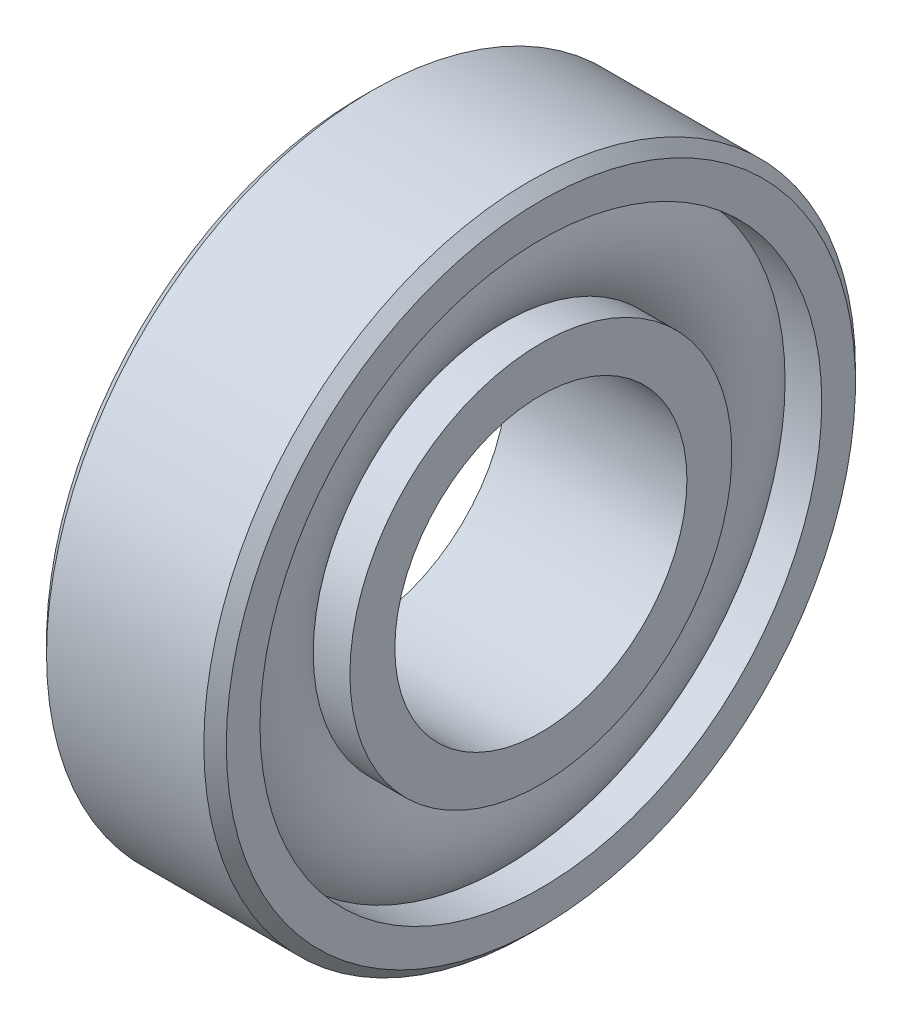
ISO-10303-21;
HEADER;
FILE_DESCRIPTION(('STEP AP214'),'2;1');
FILE_NAME('part.step','',(''),(''),'','','');
FILE_SCHEMA(('AUTOMOTIVE_DESIGN { 1 0 10303 214 1 1 1 1 }'));
ENDSEC;
DATA;
#1=APPLICATION_CONTEXT('core data for automotive mechanical design processes');
#2=APPLICATION_PROTOCOL_DEFINITION('international standard','automotive_design',2000,#1);
#3=PRODUCT_CONTEXT('',#1,'mechanical');
#4=PRODUCT('Part','Part','',(#3));
#5=PRODUCT_RELATED_PRODUCT_CATEGORY('part','',(#4));
#6=PRODUCT_DEFINITION_FORMATION('','',#4);
#7=PRODUCT_DEFINITION_CONTEXT('part definition',#1,'design');
#8=PRODUCT_DEFINITION('design','',#6,#7);
#9=PRODUCT_DEFINITION_SHAPE('','',#8);
#10=(LENGTH_UNIT() NAMED_UNIT(*) SI_UNIT(.MILLI.,.METRE.));
#11=(NAMED_UNIT(*) PLANE_ANGLE_UNIT() SI_UNIT($,.RADIAN.));
#12=(NAMED_UNIT(*) SI_UNIT($,.STERADIAN.) SOLID_ANGLE_UNIT());
#13=UNCERTAINTY_MEASURE_WITH_UNIT(LENGTH_MEASURE(1.E-05),#10,'distance_accuracy_value','');
#14=(GEOMETRIC_REPRESENTATION_CONTEXT(3) GLOBAL_UNCERTAINTY_ASSIGNED_CONTEXT((#13)) GLOBAL_UNIT_ASSIGNED_CONTEXT((#10,
#11,#12)) REPRESENTATION_CONTEXT('',''));
#15=CARTESIAN_POINT('',(0.,0.,0.));
#16=DIRECTION('',(0.,0.,1.));
#17=DIRECTION('',(1.,0.,0.));
#18=AXIS2_PLACEMENT_3D('',#15,#16,#17);
#19=CARTESIAN_POINT('',(0.,14.5,0.));
#20=DIRECTION('',(1.,0.,0.));
#21=DIRECTION('',(0.,0.,-1.));
#22=AXIS2_PLACEMENT_3D('',#19,#20,#21);
#23=PLANE('',#22);
#24=CARTESIAN_POINT('',(0.,0.,0.));
#25=DIRECTION('',(1.,0.,0.));
#26=DIRECTION('',(0.,0.,-1.));
#27=AXIS2_PLACEMENT_3D('',#24,#25,#26);
#28=CIRCLE('',#27,14.);
#29=CARTESIAN_POINT('',(0.,0.,-14.));
#30=VERTEX_POINT('',#29);
#31=EDGE_CURVE('E45',#30,#30,#28,.F.);
#32=ORIENTED_EDGE('',*,*,#31,.T.);
#33=EDGE_LOOP('',(#32));
#34=FACE_BOUND('',#33,.T.);
#35=CARTESIAN_POINT('',(0.,0.,0.));
#36=DIRECTION('',(-1.,0.,0.));
#37=DIRECTION('',(0.,0.,1.));
#38=AXIS2_PLACEMENT_3D('',#35,#36,#37);
#39=CIRCLE('',#38,12.5);
#40=CARTESIAN_POINT('',(0.,0.,12.5));
#41=VERTEX_POINT('',#40);
#42=EDGE_CURVE('E50',#41,#41,#39,.T.);
#43=ORIENTED_EDGE('',*,*,#42,.F.);
#44=EDGE_LOOP('',(#43));
#45=FACE_BOUND('',#44,.T.);
#46=ADVANCED_FACE('F31',(#34,#45),#23,.F.);
#47=CARTESIAN_POINT('',(0.,0.,0.));
#48=DIRECTION('',(-1.,0.,0.));
#49=DIRECTION('',(0.,0.,1.));
#50=AXIS2_PLACEMENT_3D('',#47,#48,#49);
#51=CYLINDRICAL_SURFACE('',#50,12.5);
#52=CARTESIAN_POINT('',(1.6314561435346,0.,0.));
#53=DIRECTION('',(-1.,0.,0.));
#54=DIRECTION('',(0.,0.,1.));
#55=AXIS2_PLACEMENT_3D('',#52,#53,#54);
#56=CIRCLE('',#55,12.5);
#57=CARTESIAN_POINT('',(1.6314561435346,0.,12.5));
#58=VERTEX_POINT('',#57);
#59=EDGE_CURVE('E53',#58,#58,#56,.T.);
#60=ORIENTED_EDGE('',*,*,#59,.F.);
#61=EDGE_LOOP('',(#60));
#62=FACE_BOUND('',#61,.T.);
#63=ORIENTED_EDGE('',*,*,#42,.T.);
#64=EDGE_LOOP('',(#63));
#65=FACE_BOUND('',#64,.T.);
#66=ADVANCED_FACE('F129',(#62,#65),#51,.F.);
#67=CARTESIAN_POINT('',(4.,0.,0.));
#68=DIRECTION('',(-1.,0.,0.));
#69=DIRECTION('',(0.,0.,1.));
#70=AXIS2_PLACEMENT_3D('',#67,#68,#69);
#71=TOROIDAL_SURFACE('',#70,10.5,3.1);
#72=CARTESIAN_POINT('',(1.6314561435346,0.,0.));
#73=DIRECTION('',(-1.,0.,0.));
#74=DIRECTION('',(0.,0.,1.));
#75=AXIS2_PLACEMENT_3D('',#72,#73,#74);
#76=CIRCLE('',#75,8.5);
#77=CARTESIAN_POINT('',(1.6314561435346,0.,8.5));
#78=VERTEX_POINT('',#77);
#79=EDGE_CURVE('E56',#78,#78,#76,.T.);
#80=ORIENTED_EDGE('',*,*,#79,.F.);
#81=EDGE_LOOP('',(#80));
#82=FACE_BOUND('',#81,.T.);
#83=ORIENTED_EDGE('',*,*,#59,.T.);
#84=EDGE_LOOP('',(#83));
#85=FACE_BOUND('',#84,.T.);
#86=ADVANCED_FACE('F123',(#82,#85),#71,.T.);
#87=CARTESIAN_POINT('',(0.,0.,0.));
#88=DIRECTION('',(-1.,0.,0.));
#89=DIRECTION('',(0.,0.,1.));
#90=AXIS2_PLACEMENT_3D('',#87,#88,#89);
#91=CYLINDRICAL_SURFACE('',#90,8.5);
#92=CARTESIAN_POINT('',(0.,0.,0.));
#93=DIRECTION('',(-1.,0.,0.));
#94=DIRECTION('',(0.,0.,1.));
#95=AXIS2_PLACEMENT_3D('',#92,#93,#94);
#96=CIRCLE('',#95,8.5);
#97=CARTESIAN_POINT('',(0.,0.,8.5));
#98=VERTEX_POINT('',#97);
#99=EDGE_CURVE('E59',#98,#98,#96,.T.);
#100=ORIENTED_EDGE('',*,*,#99,.F.);
#101=EDGE_LOOP('',(#100));
#102=FACE_BOUND('',#101,.T.);
#103=ORIENTED_EDGE('',*,*,#79,.T.);
#104=EDGE_LOOP('',(#103));
#105=FACE_BOUND('',#104,.T.);
#106=ADVANCED_FACE('F117',(#102,#105),#91,.T.);
#107=CARTESIAN_POINT('',(0.,8.5,0.));
#108=DIRECTION('',(1.,0.,0.));
#109=DIRECTION('',(0.,0.,-1.));
#110=AXIS2_PLACEMENT_3D('',#107,#108,#109);
#111=PLANE('',#110);
#112=CARTESIAN_POINT('',(0.,0.,0.));
#113=DIRECTION('',(-1.,0.,0.));
#114=DIRECTION('',(0.,0.,1.));
#115=AXIS2_PLACEMENT_3D('',#112,#113,#114);
#116=CIRCLE('',#115,6.5);
#117=CARTESIAN_POINT('',(0.,0.,6.5));
#118=VERTEX_POINT('',#117);
#119=EDGE_CURVE('E62',#118,#118,#116,.T.);
#120=ORIENTED_EDGE('',*,*,#119,.F.);
#121=EDGE_LOOP('',(#120));
#122=FACE_BOUND('',#121,.T.);
#123=ORIENTED_EDGE('',*,*,#99,.T.);
#124=EDGE_LOOP('',(#123));
#125=FACE_BOUND('',#124,.T.);
#126=ADVANCED_FACE('F111',(#122,#125),#111,.F.);
#127=CARTESIAN_POINT('',(0.,0.,0.));
#128=DIRECTION('',(-1.,0.,0.));
#129=DIRECTION('',(0.,0.,1.));
#130=AXIS2_PLACEMENT_3D('',#127,#128,#129);
#131=CYLINDRICAL_SURFACE('',#130,6.5);
#132=CARTESIAN_POINT('',(8.,0.,0.));
#133=DIRECTION('',(-1.,0.,0.));
#134=DIRECTION('',(0.,0.,1.));
#135=AXIS2_PLACEMENT_3D('',#132,#133,#134);
#136=CIRCLE('',#135,6.5);
#137=CARTESIAN_POINT('',(8.,0.,6.5));
#138=VERTEX_POINT('',#137);
#139=EDGE_CURVE('E65',#138,#138,#136,.T.);
#140=ORIENTED_EDGE('',*,*,#139,.F.);
#141=EDGE_LOOP('',(#140));
#142=FACE_BOUND('',#141,.T.);
#143=ORIENTED_EDGE('',*,*,#119,.T.);
#144=EDGE_LOOP('',(#143));
#145=FACE_BOUND('',#144,.T.);
#146=ADVANCED_FACE('F105',(#142,#145),#131,.F.);
#147=CARTESIAN_POINT('',(8.,8.5,0.));
#148=DIRECTION('',(-1.,0.,0.));
#149=DIRECTION('',(0.,0.,1.));
#150=AXIS2_PLACEMENT_3D('',#147,#148,#149);
#151=PLANE('',#150);
#152=CARTESIAN_POINT('',(8.,0.,0.));
#153=DIRECTION('',(-1.,0.,0.));
#154=DIRECTION('',(0.,0.,1.));
#155=AXIS2_PLACEMENT_3D('',#152,#153,#154);
#156=CIRCLE('',#155,8.5);
#157=CARTESIAN_POINT('',(8.,0.,8.5));
#158=VERTEX_POINT('',#157);
#159=EDGE_CURVE('E69',#158,#158,#156,.T.);
#160=ORIENTED_EDGE('',*,*,#159,.F.);
#161=EDGE_LOOP('',(#160));
#162=FACE_BOUND('',#161,.T.);
#163=ORIENTED_EDGE('',*,*,#139,.T.);
#164=EDGE_LOOP('',(#163));
#165=FACE_BOUND('',#164,.T.);
#166=ADVANCED_FACE('F99',(#162,#165),#151,.F.);
#167=CARTESIAN_POINT('',(0.,0.,0.));
#168=DIRECTION('',(-1.,0.,0.));
#169=DIRECTION('',(0.,0.,1.));
#170=AXIS2_PLACEMENT_3D('',#167,#168,#169);
#171=CYLINDRICAL_SURFACE('',#170,8.5);
#172=CARTESIAN_POINT('',(6.3685438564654,0.,0.));
#173=DIRECTION('',(-1.,0.,0.));
#174=DIRECTION('',(0.,0.,1.));
#175=AXIS2_PLACEMENT_3D('',#172,#173,#174);
#176=CIRCLE('',#175,8.5);
#177=CARTESIAN_POINT('',(6.3685438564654,0.,8.5));
#178=VERTEX_POINT('',#177);
#179=EDGE_CURVE('E72',#178,#178,#176,.T.);
#180=ORIENTED_EDGE('',*,*,#179,.F.);
#181=EDGE_LOOP('',(#180));
#182=FACE_BOUND('',#181,.T.);
#183=ORIENTED_EDGE('',*,*,#159,.T.);
#184=EDGE_LOOP('',(#183));
#185=FACE_BOUND('',#184,.T.);
#186=ADVANCED_FACE('F93',(#182,#185),#171,.T.);
#187=CARTESIAN_POINT('',(4.,0.,0.));
#188=DIRECTION('',(-1.,0.,0.));
#189=DIRECTION('',(0.,0.,1.));
#190=AXIS2_PLACEMENT_3D('',#187,#188,#189);
#191=TOROIDAL_SURFACE('',#190,10.5,3.1);
#192=CARTESIAN_POINT('',(6.3685438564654,0.,0.));
#193=DIRECTION('',(-1.,0.,0.));
#194=DIRECTION('',(0.,0.,1.));
#195=AXIS2_PLACEMENT_3D('',#192,#193,#194);
#196=CIRCLE('',#195,12.5);
#197=CARTESIAN_POINT('',(6.3685438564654,0.,12.5));
#198=VERTEX_POINT('',#197);
#199=EDGE_CURVE('E75',#198,#198,#196,.T.);
#200=ORIENTED_EDGE('',*,*,#199,.F.);
#201=EDGE_LOOP('',(#200));
#202=FACE_BOUND('',#201,.T.);
#203=ORIENTED_EDGE('',*,*,#179,.T.);
#204=EDGE_LOOP('',(#203));
#205=FACE_BOUND('',#204,.T.);
#206=ADVANCED_FACE('F87',(#202,#205),#191,.T.);
#207=CARTESIAN_POINT('',(0.,0.,0.));
#208=DIRECTION('',(-1.,0.,0.));
#209=DIRECTION('',(0.,0.,1.));
#210=AXIS2_PLACEMENT_3D('',#207,#208,#209);
#211=CYLINDRICAL_SURFACE('',#210,12.5);
#212=CARTESIAN_POINT('',(8.,0.,0.));
#213=DIRECTION('',(-1.,0.,0.));
#214=DIRECTION('',(0.,0.,1.));
#215=AXIS2_PLACEMENT_3D('',#212,#213,#214);
#216=CIRCLE('',#215,12.5);
#217=CARTESIAN_POINT('',(8.,0.,12.5));
#218=VERTEX_POINT('',#217);
#219=EDGE_CURVE('E78',#218,#218,#216,.T.);
#220=ORIENTED_EDGE('',*,*,#219,.F.);
#221=EDGE_LOOP('',(#220));
#222=FACE_BOUND('',#221,.T.);
#223=ORIENTED_EDGE('',*,*,#199,.T.);
#224=EDGE_LOOP('',(#223));
#225=FACE_BOUND('',#224,.T.);
#226=ADVANCED_FACE('F84',(#222,#225),#211,.F.);
#227=CARTESIAN_POINT('',(8.,14.5,0.));
#228=DIRECTION('',(-1.,0.,0.));
#229=DIRECTION('',(0.,0.,1.));
#230=AXIS2_PLACEMENT_3D('',#227,#228,#229);
#231=PLANE('',#230);
#232=CARTESIAN_POINT('',(8.,0.,0.));
#233=DIRECTION('',(-1.,0.,0.));
#234=DIRECTION('',(0.,0.,1.));
#235=AXIS2_PLACEMENT_3D('',#232,#233,#234);
#236=CIRCLE('',#235,14.);
#237=CARTESIAN_POINT('',(8.,0.,14.));
#238=VERTEX_POINT('',#237);
#239=EDGE_CURVE('E10',#238,#238,#236,.F.);
#240=ORIENTED_EDGE('',*,*,#239,.T.);
#241=EDGE_LOOP('',(#240));
#242=FACE_BOUND('',#241,.T.);
#243=ORIENTED_EDGE('',*,*,#219,.T.);
#244=EDGE_LOOP('',(#243));
#245=FACE_BOUND('',#244,.T.);
#246=ADVANCED_FACE('F82',(#242,#245),#231,.F.);
#247=CARTESIAN_POINT('',(0.,0.,0.));
#248=DIRECTION('',(-1.,0.,0.));
#249=DIRECTION('',(0.,0.,1.));
#250=AXIS2_PLACEMENT_3D('',#247,#248,#249);
#251=CYLINDRICAL_SURFACE('',#250,14.5);
#252=CARTESIAN_POINT('',(0.500000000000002,0.,0.));
#253=DIRECTION('',(1.,0.,0.));
#254=DIRECTION('',(0.,0.,-1.));
#255=AXIS2_PLACEMENT_3D('',#252,#253,#254);
#256=CIRCLE('',#255,14.5);
#257=CARTESIAN_POINT('',(0.500000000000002,0.,-14.5));
#258=VERTEX_POINT('',#257);
#259=EDGE_CURVE('E37',#258,#258,#256,.T.);
#260=ORIENTED_EDGE('',*,*,#259,.T.);
#261=EDGE_LOOP('',(#260));
#262=FACE_BOUND('',#261,.T.);
#263=CARTESIAN_POINT('',(7.5,0.,0.));
#264=DIRECTION('',(-1.,0.,0.));
#265=DIRECTION('',(0.,0.,1.));
#266=AXIS2_PLACEMENT_3D('',#263,#264,#265);
#267=CIRCLE('',#266,14.5);
#268=CARTESIAN_POINT('',(7.5,0.,14.5));
#269=VERTEX_POINT('',#268);
#270=EDGE_CURVE('E41',#269,#269,#267,.T.);
#271=ORIENTED_EDGE('',*,*,#270,.T.);
#272=EDGE_LOOP('',(#271));
#273=FACE_BOUND('',#272,.T.);
#274=ADVANCED_FACE('F146',(#262,#273),#251,.T.);
#275=CARTESIAN_POINT('',(0.,0.,0.));
#276=DIRECTION('',(1.,0.,0.));
#277=DIRECTION('',(0.,0.,-1.));
#278=AXIS2_PLACEMENT_3D('',#275,#276,#277);
#279=CONICAL_SURFACE('',#278,14.,0.785398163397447);
#280=ORIENTED_EDGE('',*,*,#259,.F.);
#281=EDGE_LOOP('',(#280));
#282=FACE_BOUND('',#281,.T.);
#283=ORIENTED_EDGE('',*,*,#31,.F.);
#284=EDGE_LOOP('',(#283));
#285=FACE_BOUND('',#284,.T.);
#286=ADVANCED_FACE('F143',(#282,#285),#279,.T.);
#287=CARTESIAN_POINT('',(7.5,0.,0.));
#288=DIRECTION('',(-1.,0.,0.));
#289=DIRECTION('',(0.,0.,1.));
#290=AXIS2_PLACEMENT_3D('',#287,#288,#289);
#291=CONICAL_SURFACE('',#290,14.5,0.785398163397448);
#292=ORIENTED_EDGE('',*,*,#239,.F.);
#293=EDGE_LOOP('',(#292));
#294=FACE_BOUND('',#293,.T.);
#295=ORIENTED_EDGE('',*,*,#270,.F.);
#296=EDGE_LOOP('',(#295));
#297=FACE_BOUND('',#296,.T.);
#298=ADVANCED_FACE('F145',(#294,#297),#291,.T.);
#299=CLOSED_SHELL('',(#46,#66,#86,#106,#126,#146,#166,#186,#206,#226,#246,#274,#286,#298));
#300=MANIFOLD_SOLID_BREP('B2',#299);
#301=ADVANCED_BREP_SHAPE_REPRESENTATION('',(#18,#300),#14);
#302=SHAPE_DEFINITION_REPRESENTATION(#9,#301);
ENDSEC;
END-ISO-10303-21;
